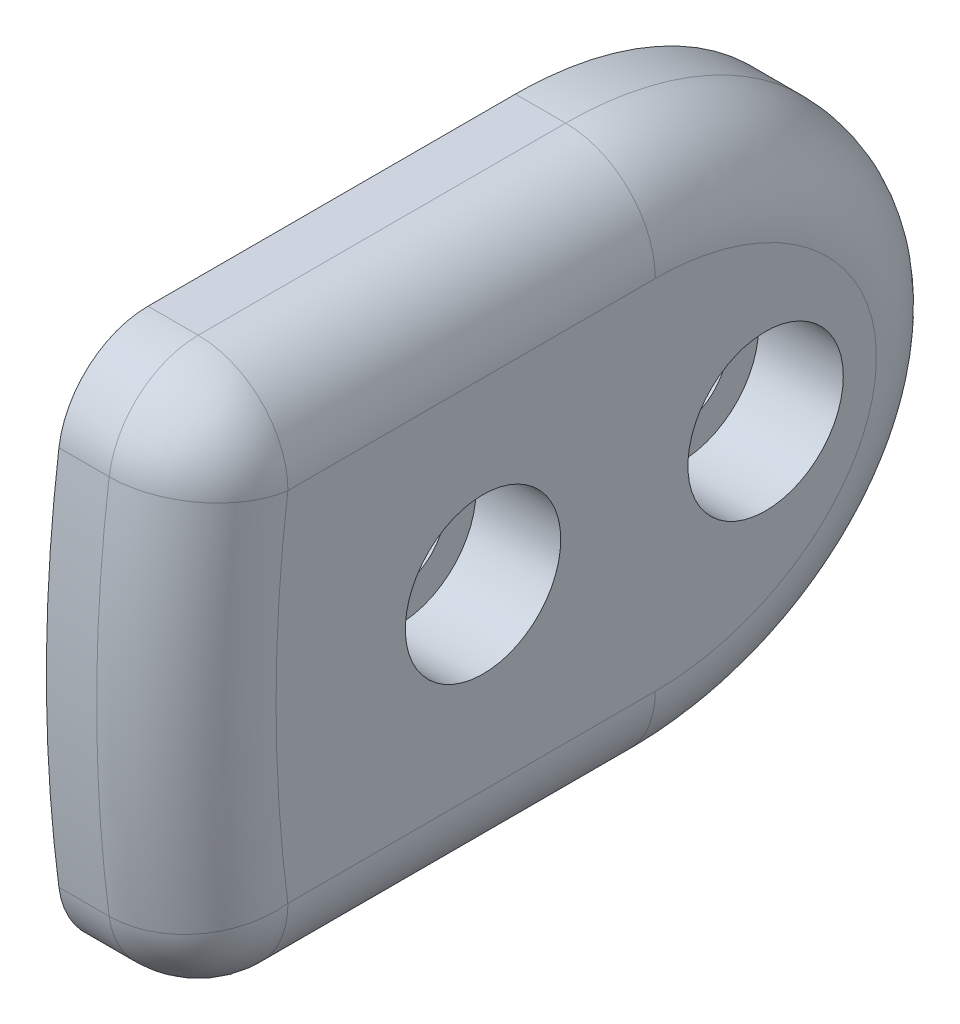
ISO-10303-21;
HEADER;
FILE_DESCRIPTION(('STEP AP214'),'2;1');
FILE_NAME('part.step','',(''),(''),'','','');
FILE_SCHEMA(('AUTOMOTIVE_DESIGN { 1 0 10303 214 1 1 1 1 }'));
ENDSEC;
DATA;
#1=APPLICATION_CONTEXT('core data for automotive mechanical design processes');
#2=APPLICATION_PROTOCOL_DEFINITION('international standard','automotive_design',2000,#1);
#3=PRODUCT_CONTEXT('',#1,'mechanical');
#4=PRODUCT('Part','Part','',(#3));
#5=PRODUCT_RELATED_PRODUCT_CATEGORY('part','',(#4));
#6=PRODUCT_DEFINITION_FORMATION('','',#4);
#7=PRODUCT_DEFINITION_CONTEXT('part definition',#1,'design');
#8=PRODUCT_DEFINITION('design','',#6,#7);
#9=PRODUCT_DEFINITION_SHAPE('','',#8);
#10=(LENGTH_UNIT() NAMED_UNIT(*) SI_UNIT(.MILLI.,.METRE.));
#11=(NAMED_UNIT(*) PLANE_ANGLE_UNIT() SI_UNIT($,.RADIAN.));
#12=(NAMED_UNIT(*) SI_UNIT($,.STERADIAN.) SOLID_ANGLE_UNIT());
#13=UNCERTAINTY_MEASURE_WITH_UNIT(LENGTH_MEASURE(1.E-05),#10,'distance_accuracy_value','');
#14=(GEOMETRIC_REPRESENTATION_CONTEXT(3) GLOBAL_UNCERTAINTY_ASSIGNED_CONTEXT((#13)) GLOBAL_UNIT_ASSIGNED_CONTEXT((#10,
#11,#12)) REPRESENTATION_CONTEXT('',''));
#15=CARTESIAN_POINT('',(0.,0.,0.));
#16=DIRECTION('',(0.,0.,1.));
#17=DIRECTION('',(1.,0.,0.));
#18=AXIS2_PLACEMENT_3D('',#15,#16,#17);
#19=CARTESIAN_POINT('',(9.906,12.6399999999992,95.809811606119));
#20=DIRECTION('',(-1.,0.,0.));
#21=DIRECTION('',(0.,0.,1.));
#22=AXIS2_PLACEMENT_3D('',#19,#20,#21);
#23=CYLINDRICAL_SURFACE('',#22,6.36);
#24=DIRECTION('',(-1.,0.,0.));
#25=VECTOR('',#24,1.);
#26=CARTESIAN_POINT('',(9.906,13.4718543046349,102.11517586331));
#27=LINE('',#26,#25);
#28=CARTESIAN_POINT('',(3.556,13.4718543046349,102.11517586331));
#29=VERTEX_POINT('',#28);
#30=CARTESIAN_POINT('',(0.,13.4718543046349,102.11517586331));
#31=VERTEX_POINT('',#30);
#32=EDGE_CURVE('E243',#29,#31,#27,.T.);
#33=ORIENTED_EDGE('',*,*,#32,.F.);
#34=CARTESIAN_POINT('',(3.556,12.6399999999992,95.809811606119));
#35=DIRECTION('',(1.,0.,0.));
#36=DIRECTION('',(0.,0.,-1.));
#37=AXIS2_PLACEMENT_3D('',#34,#35,#36);
#38=CIRCLE('',#37,6.36);
#39=CARTESIAN_POINT('',(3.556,18.9999999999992,95.809811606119));
#40=VERTEX_POINT('',#39);
#41=EDGE_CURVE('E201',#29,#40,#38,.F.);
#42=ORIENTED_EDGE('',*,*,#41,.T.);
#43=DIRECTION('',(-1.,0.,0.));
#44=VECTOR('',#43,1.);
#45=CARTESIAN_POINT('',(9.906,18.9999999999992,95.809811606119));
#46=LINE('',#45,#44);
#47=CARTESIAN_POINT('',(0.,18.9999999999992,95.809811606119));
#48=VERTEX_POINT('',#47);
#49=EDGE_CURVE('E147',#40,#48,#46,.T.);
#50=ORIENTED_EDGE('',*,*,#49,.T.);
#51=CARTESIAN_POINT('',(0.,12.6399999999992,95.809811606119));
#52=DIRECTION('',(1.,0.,0.));
#53=DIRECTION('',(0.,0.,-1.));
#54=AXIS2_PLACEMENT_3D('',#51,#52,#53);
#55=CIRCLE('',#54,6.36);
#56=EDGE_CURVE('E116',#48,#31,#55,.T.);
#57=ORIENTED_EDGE('',*,*,#56,.T.);
#58=EDGE_LOOP('',(#33,#42,#50,#57));
#59=FACE_BOUND('',#58,.T.);
#60=ADVANCED_FACE('F38',(#59),#23,.T.);
#61=CARTESIAN_POINT('',(9.906,0.,0.));
#62=DIRECTION('',(-1.,0.,0.));
#63=DIRECTION('',(0.,0.,1.));
#64=AXIS2_PLACEMENT_3D('',#61,#62,#63);
#65=CYLINDRICAL_SURFACE('',#64,103.);
#66=DIRECTION('',(-1.,0.,0.));
#67=VECTOR('',#66,1.);
#68=CARTESIAN_POINT('',(9.906,-13.4718543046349,102.11517586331));
#69=LINE('',#68,#67);
#70=CARTESIAN_POINT('',(3.556,-13.4718543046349,102.11517586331));
#71=VERTEX_POINT('',#70);
#72=CARTESIAN_POINT('',(0.,-13.4718543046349,102.11517586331));
#73=VERTEX_POINT('',#72);
#74=EDGE_CURVE('E122',#71,#73,#69,.T.);
#75=ORIENTED_EDGE('',*,*,#74,.F.);
#76=CARTESIAN_POINT('',(3.556,0.,0.));
#77=DIRECTION('',(1.,0.,0.));
#78=DIRECTION('',(0.,0.,-1.));
#79=AXIS2_PLACEMENT_3D('',#76,#77,#78);
#80=CIRCLE('',#79,103.);
#81=EDGE_CURVE('E47',#71,#29,#80,.F.);
#82=ORIENTED_EDGE('',*,*,#81,.T.);
#83=ORIENTED_EDGE('',*,*,#32,.T.);
#84=CARTESIAN_POINT('',(0.,0.,0.));
#85=DIRECTION('',(1.,0.,0.));
#86=DIRECTION('',(0.,0.,-1.));
#87=AXIS2_PLACEMENT_3D('',#84,#85,#86);
#88=CIRCLE('',#87,103.);
#89=EDGE_CURVE('E141',#31,#73,#88,.T.);
#90=ORIENTED_EDGE('',*,*,#89,.T.);
#91=EDGE_LOOP('',(#75,#82,#83,#90));
#92=FACE_BOUND('',#91,.T.);
#93=ADVANCED_FACE('F158',(#92),#65,.T.);
#94=CARTESIAN_POINT('',(9.906,-7.6492442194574E-13,69.805461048));
#95=DIRECTION('',(1.,0.,0.));
#96=DIRECTION('',(0.,0.,-1.));
#97=AXIS2_PLACEMENT_3D('',#94,#95,#96);
#98=ELLIPSE('',#97,22.,19.);
#99=DIRECTION('',(-1.,0.,0.));
#100=VECTOR('',#99,1.);
#101=SURFACE_OF_LINEAR_EXTRUSION('',#98,#100);
#102=DIRECTION('',(-1.,0.,0.));
#103=VECTOR('',#102,1.);
#104=CARTESIAN_POINT('',(9.906,18.9999999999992,69.805461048));
#105=LINE('',#104,#103);
#106=CARTESIAN_POINT('',(3.556,18.9999999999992,69.805461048));
#107=VERTEX_POINT('',#106);
#108=CARTESIAN_POINT('',(0.,18.9999999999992,69.805461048));
#109=VERTEX_POINT('',#108);
#110=EDGE_CURVE('E245',#107,#109,#105,.T.);
#111=ORIENTED_EDGE('',*,*,#110,.F.);
#112=CARTESIAN_POINT('',(9.906,11.321750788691,76.7502889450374));
#113=CARTESIAN_POINT('',(9.906,17.2091864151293,79.1294908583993));
#114=CARTESIAN_POINT('',(3.556,17.2091864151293,79.1294908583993));
#115=CARTESIAN_POINT('',(9.906,11.50258402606,76.3027592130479));
#116=CARTESIAN_POINT('',(9.906,17.4559450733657,78.5186164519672));
#117=CARTESIAN_POINT('',(3.556,17.4559450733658,78.5186164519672));
#118=CARTESIAN_POINT('',(9.906,11.6647955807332,75.8478121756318));
#119=CARTESIAN_POINT('',(9.906,17.676155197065,77.9007972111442));
#120=CARTESIAN_POINT('',(3.556,17.676155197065,77.9007972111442));
#121=CARTESIAN_POINT('',(9.906,11.9522029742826,74.9262733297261));
#122=CARTESIAN_POINT('',(9.906,18.0649243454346,76.6543807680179));
#123=CARTESIAN_POINT('',(3.556,18.0649243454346,76.6543807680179));
#124=CARTESIAN_POINT('',(9.906,12.0773926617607,74.4596796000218));
#125=CARTESIAN_POINT('',(9.906,18.233474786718,76.0257817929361));
#126=CARTESIAN_POINT('',(3.556,18.233474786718,76.0257817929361));
#127=CARTESIAN_POINT('',(9.906,12.2899968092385,73.5222763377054));
#128=CARTESIAN_POINT('',(9.906,18.5190440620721,74.7666142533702));
#129=CARTESIAN_POINT('',(3.556,18.5190440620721,74.7666142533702));
#130=CARTESIAN_POINT('',(9.906,12.3777298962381,73.0515386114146));
#131=CARTESIAN_POINT('',(9.906,18.636497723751,74.1361102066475));
#132=CARTESIAN_POINT('',(3.556,18.636497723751,74.1361102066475));
#133=CARTESIAN_POINT('',(9.906,12.5171202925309,72.1049306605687));
#134=CARTESIAN_POINT('',(9.906,18.8228479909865,72.8706163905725));
#135=CARTESIAN_POINT('',(3.556,18.8228479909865,72.8706163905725));
#136=CARTESIAN_POINT('',(9.906,12.5687941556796,71.6290628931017));
#137=CARTESIAN_POINT('',(9.906,18.8917668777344,72.2356288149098));
#138=CARTESIAN_POINT('',(3.556,18.8917668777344,72.2356288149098));
#139=CARTESIAN_POINT('',(9.906,12.6183307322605,70.9281013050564));
#140=CARTESIAN_POINT('',(9.906,18.9578053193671,71.3011250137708));
#141=CARTESIAN_POINT('',(3.556,18.9578053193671,71.3011250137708));
#142=CARTESIAN_POINT('',(9.906,12.6301975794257,70.7039186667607));
#143=CARTESIAN_POINT('',(9.906,18.9736184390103,71.0023767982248));
#144=CARTESIAN_POINT('',(3.556,18.9736184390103,71.0023767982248));
#145=CARTESIAN_POINT('',(9.906,12.6460375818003,70.2549886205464));
#146=CARTESIAN_POINT('',(9.906,18.9947222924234,70.4042538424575));
#147=CARTESIAN_POINT('',(3.556,18.9947222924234,70.4042538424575));
#148=CARTESIAN_POINT('',(9.906,12.6500004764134,70.0302408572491));
#149=CARTESIAN_POINT('',(9.906,18.9999993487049,70.1048787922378));
#150=CARTESIAN_POINT('',(3.556,18.9999993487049,70.1048787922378));
#151=CARTESIAN_POINT('',(9.906,12.6499987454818,69.2135596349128));
#152=CARTESIAN_POINT('',(9.906,19.0000017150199,69.0170192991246));
#153=CARTESIAN_POINT('',(3.556,19.0000017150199,69.0170192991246));
#154=CARTESIAN_POINT('',(9.906,12.6225154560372,68.6214360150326));
#155=CARTESIAN_POINT('',(9.906,18.9634168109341,68.2282815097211));
#156=CARTESIAN_POINT('',(3.556,18.9634168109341,68.2282815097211));
#157=CARTESIAN_POINT('',(9.906,12.512444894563,67.4419434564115));
#158=CARTESIAN_POINT('',(9.906,18.8165809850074,66.654831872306));
#159=CARTESIAN_POINT('',(3.556,18.8165809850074,66.654831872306));
#160=CARTESIAN_POINT('',(9.906,12.4298129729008,66.8545787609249));
#161=CARTESIAN_POINT('',(9.906,18.7062703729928,65.8701238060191));
#162=CARTESIAN_POINT('',(3.556,18.7062703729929,65.8701238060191));
#163=CARTESIAN_POINT('',(9.906,12.2089729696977,65.689280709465));
#164=CARTESIAN_POINT('',(9.906,18.4103555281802,64.3086753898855));
#165=CARTESIAN_POINT('',(3.556,18.4103555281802,64.3086753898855));
#166=CARTESIAN_POINT('',(9.906,12.0706690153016,65.1113654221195));
#167=CARTESIAN_POINT('',(9.906,18.2246214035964,63.5319511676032));
#168=CARTESIAN_POINT('',(3.556,18.2246214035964,63.5319511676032));
#169=CARTESIAN_POINT('',(9.906,11.7381710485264,63.9720383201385));
#170=CARTESIAN_POINT('',(9.906,17.7757026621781,61.9936839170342));
#171=CARTESIAN_POINT('',(3.556,17.7757026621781,61.9936839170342));
#172=CARTESIAN_POINT('',(9.906,11.5440064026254,63.4106180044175));
#173=CARTESIAN_POINT('',(9.906,17.5125587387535,61.2321331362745));
#174=CARTESIAN_POINT('',(3.556,17.5125587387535,61.2321331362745));
#175=CARTESIAN_POINT('',(9.906,11.157304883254,62.4537018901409));
#176=CARTESIAN_POINT('',(9.906,16.9847225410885,59.9259901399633));
#177=CARTESIAN_POINT('',(3.556,16.9847225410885,59.9259901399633));
#178=CARTESIAN_POINT('',(9.906,10.9774807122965,62.0530309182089));
#179=CARTESIAN_POINT('',(9.906,16.7382358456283,59.3764882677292));
#180=CARTESIAN_POINT('',(3.556,16.7382358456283,59.3764882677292));
#181=CARTESIAN_POINT('',(9.906,10.5869250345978,61.2670076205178));
#182=CARTESIAN_POINT('',(9.906,16.1995975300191,58.2924314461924));
#183=CARTESIAN_POINT('',(3.556,16.1995975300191,58.2924314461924));
#184=CARTESIAN_POINT('',(9.906,10.3761960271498,60.8816540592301));
#185=CARTESIAN_POINT('',(9.906,15.9074496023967,57.7578752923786));
#186=CARTESIAN_POINT('',(3.556,15.9074496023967,57.7578752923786));
#187=CARTESIAN_POINT('',(9.906,9.92422904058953,60.1301916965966));
#188=CARTESIAN_POINT('',(9.906,15.2763205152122,56.7085292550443));
#189=CARTESIAN_POINT('',(3.556,15.2763205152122,56.7085292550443));
#190=CARTESIAN_POINT('',(9.906,9.68304719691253,59.7640491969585));
#191=CARTESIAN_POINT('',(9.906,14.9374254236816,56.1937052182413));
#192=CARTESIAN_POINT('',(3.556,14.9374254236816,56.1937052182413));
#193=CARTESIAN_POINT('',(9.906,9.17003714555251,59.0538827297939));
#194=CARTESIAN_POINT('',(9.906,14.2105615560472,55.1874949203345));
#195=CARTESIAN_POINT('',(3.556,14.2105615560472,55.1874949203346));
#196=CARTESIAN_POINT('',(9.906,8.89821404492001,58.7098550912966));
#197=CARTESIAN_POINT('',(9.906,13.8226009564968,54.6961047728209));
#198=CARTESIAN_POINT('',(3.556,13.8226009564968,54.6961047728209));
#199=CARTESIAN_POINT('',(9.906,8.37750267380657,58.1092299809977));
#200=CARTESIAN_POINT('',(9.906,13.0724068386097,53.8307837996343));
#201=CARTESIAN_POINT('',(3.556,13.0724068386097,53.8307837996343));
#202=CARTESIAN_POINT('',(9.906,8.13367799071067,57.8482340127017));
#203=CARTESIAN_POINT('',(9.906,12.718696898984,53.4519436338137));
#204=CARTESIAN_POINT('',(3.556,12.718696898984,53.4519436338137));
#205=CARTESIAN_POINT('',(9.906,7.62644994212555,57.3460438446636));
#206=CARTESIAN_POINT('',(9.906,11.9768032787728,52.7174174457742));
#207=CARTESIAN_POINT('',(3.556,11.9768032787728,52.7174174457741));
#208=CARTESIAN_POINT('',(9.906,7.3630504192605,57.1048457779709));
#209=CARTESIAN_POINT('',(9.906,11.5886263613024,52.3617269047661));
#210=CARTESIAN_POINT('',(3.556,11.5886263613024,52.3617269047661));
#211=CARTESIAN_POINT('',(9.906,6.81729056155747,56.6447731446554));
#212=CARTESIAN_POINT('',(9.906,10.7772715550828,51.677760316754));
#213=CARTESIAN_POINT('',(3.556,10.7772715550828,51.677760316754));
#214=CARTESIAN_POINT('',(9.906,6.53492645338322,56.4259030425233));
#215=CARTESIAN_POINT('',(9.906,10.354086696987,51.3494897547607));
#216=CARTESIAN_POINT('',(3.556,10.354086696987,51.3494897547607));
#217=CARTESIAN_POINT('',(9.906,5.95232346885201,56.0133109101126));
#218=CARTESIAN_POINT('',(9.906,9.47299567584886,50.7255136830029));
#219=CARTESIAN_POINT('',(3.556,9.47299567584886,50.7255136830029));
#220=CARTESIAN_POINT('',(9.906,5.65208422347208,55.8195893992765));
#221=CARTESIAN_POINT('',(9.906,9.01508879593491,50.4298088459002));
#222=CARTESIAN_POINT('',(3.556,9.01508879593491,50.4298088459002));
#223=CARTESIAN_POINT('',(9.906,5.03243067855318,55.4585518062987));
#224=CARTESIAN_POINT('',(9.906,8.06147471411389,49.8741937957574));
#225=CARTESIAN_POINT('',(3.556,8.06147471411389,49.8741937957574));
#226=CARTESIAN_POINT('',(9.906,4.71286776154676,55.291489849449));
#227=CARTESIAN_POINT('',(9.906,7.56546362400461,49.614630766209));
#228=CARTESIAN_POINT('',(3.556,7.56546362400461,49.614630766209));
#229=CARTESIAN_POINT('',(9.906,4.05910884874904,54.9888334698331));
#230=CARTESIAN_POINT('',(9.906,6.54198114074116,49.1408159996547));
#231=CARTESIAN_POINT('',(3.556,6.54198114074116,49.1408159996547));
#232=CARTESIAN_POINT('',(9.906,3.72491257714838,54.8532396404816));
#233=CARTESIAN_POINT('',(9.906,6.01450915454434,48.9265651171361));
#234=CARTESIAN_POINT('',(3.556,6.01450915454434,48.9265651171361));
#235=CARTESIAN_POINT('',(9.906,3.04494244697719,54.6163816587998));
#236=CARTESIAN_POINT('',(9.906,4.93325381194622,48.549929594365));
#237=CARTESIAN_POINT('',(3.556,4.93325381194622,48.549929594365));
#238=CARTESIAN_POINT('',(9.906,2.69918187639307,54.5150794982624));
#239=CARTESIAN_POINT('',(9.906,4.37950036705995,48.3874875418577));
#240=CARTESIAN_POINT('',(3.556,4.37950036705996,48.3874875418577));
#241=CARTESIAN_POINT('',(9.906,1.99902826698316,54.348894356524));
#242=CARTESIAN_POINT('',(9.906,3.2517864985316,48.1198257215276));
#243=CARTESIAN_POINT('',(3.556,3.2517864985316,48.1198257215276));
#244=CARTESIAN_POINT('',(9.906,1.64463700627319,54.2840039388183));
#245=CARTESIAN_POINT('',(9.906,2.67783022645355,48.0145942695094));
#246=CARTESIAN_POINT('',(3.556,2.67783022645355,48.0145942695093));
#247=CARTESIAN_POINT('',(9.906,0.985142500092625,54.1991551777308));
#248=CARTESIAN_POINT('',(9.906,1.60621933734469,47.8767207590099));
#249=CARTESIAN_POINT('',(3.556,1.60621933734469,47.8767207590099));
#250=CARTESIAN_POINT('',(9.906,0.680714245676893,54.1738755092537));
#251=CARTESIAN_POINT('',(9.906,1.11019213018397,47.8354910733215));
#252=CARTESIAN_POINT('',(3.556,1.11019213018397,47.8354910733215));
#253=CARTESIAN_POINT('',(9.906,0.0708358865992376,54.1510871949));
#254=CARTESIAN_POINT('',(9.906,0.11565172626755,47.798331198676));
#255=CARTESIAN_POINT('',(3.556,0.11565172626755,47.798331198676));
#256=CARTESIAN_POINT('',(9.906,-0.23461409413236,54.1535752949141));
#257=CARTESIAN_POINT('',(9.906,-0.382861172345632,47.8023957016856));
#258=CARTESIAN_POINT('',(3.556,-0.382861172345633,47.8023957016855));
#259=CARTESIAN_POINT('',(9.906,-0.843944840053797,54.1862703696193));
#260=CARTESIAN_POINT('',(9.906,-1.3761542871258,47.855692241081));
#261=CARTESIAN_POINT('',(3.556,-1.3761542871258,47.855692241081));
#262=CARTESIAN_POINT('',(9.906,-1.14782595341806,54.2164709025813));
#263=CARTESIAN_POINT('',(9.906,-1.8709353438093,47.9049137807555));
#264=CARTESIAN_POINT('',(3.556,-1.8709353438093,47.9049137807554));
#265=CARTESIAN_POINT('',(9.906,-1.7516420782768,54.3040292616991));
#266=CARTESIAN_POINT('',(9.906,-2.85106858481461,48.0470398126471));
#267=CARTESIAN_POINT('',(3.556,-2.85106858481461,48.0470398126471));
#268=CARTESIAN_POINT('',(9.906,-2.05157711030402,54.3613869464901));
#269=CARTESIAN_POINT('',(9.906,-3.33642081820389,48.1399440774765));
#270=CARTESIAN_POINT('',(3.556,-3.33642081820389,48.1399440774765));
#271=CARTESIAN_POINT('',(9.906,-2.62514693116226,54.4974884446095));
#272=CARTESIAN_POINT('',(9.906,-4.2602586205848,48.3591572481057));
#273=CARTESIAN_POINT('',(3.556,-4.2602586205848,48.3591572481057));
#274=CARTESIAN_POINT('',(9.906,-2.89918949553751,54.5745254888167));
#275=CARTESIAN_POINT('',(9.906,-4.69969510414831,48.4827850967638));
#276=CARTESIAN_POINT('',(3.556,-4.69969510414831,48.4827850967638));
#277=CARTESIAN_POINT('',(9.906,-3.44021612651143,54.7502337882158));
#278=CARTESIAN_POINT('',(9.906,-5.56256481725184,48.7630166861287));
#279=CARTESIAN_POINT('',(3.556,-5.56256481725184,48.7630166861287));
#280=CARTESIAN_POINT('',(9.906,-3.70720063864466,54.8489036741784));
#281=CARTESIAN_POINT('',(9.906,-5.9859990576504,48.9196183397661));
#282=CARTESIAN_POINT('',(3.556,-5.9859990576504,48.9196183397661));
#283=CARTESIAN_POINT('',(9.906,-4.23274564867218,55.0666086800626));
#284=CARTESIAN_POINT('',(9.906,-6.81438211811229,49.2627711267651));
#285=CARTESIAN_POINT('',(3.556,-6.81438211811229,49.2627711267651));
#286=CARTESIAN_POINT('',(9.906,-4.49130525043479,55.1856459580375));
#287=CARTESIAN_POINT('',(9.906,-7.21932897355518,49.4493254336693));
#288=CARTESIAN_POINT('',(3.556,-7.21932897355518,49.4493254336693));
#289=CARTESIAN_POINT('',(9.906,-4.9988115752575,55.4426780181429));
#290=CARTESIAN_POINT('',(9.906,-8.0089289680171,49.8492264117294));
#291=CARTESIAN_POINT('',(3.556,-8.00892896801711,49.8492264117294));
#292=CARTESIAN_POINT('',(9.906,-5.24775770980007,55.5806739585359));
#293=CARTESIAN_POINT('',(9.906,-8.39358086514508,50.0625747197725));
#294=CARTESIAN_POINT('',(3.556,-8.39358086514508,50.0625747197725));
#295=CARTESIAN_POINT('',(9.906,-5.75587799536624,55.8867004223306));
#296=CARTESIAN_POINT('',(9.906,-9.17336903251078,50.5322159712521));
#297=CARTESIAN_POINT('',(3.556,-9.17336903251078,50.5322159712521));
#298=CARTESIAN_POINT('',(9.906,-6.0141152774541,56.0562884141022));
#299=CARTESIAN_POINT('',(9.906,-9.56660433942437,50.7906193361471));
#300=CARTESIAN_POINT('',(3.556,-9.56660433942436,50.7906193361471));
#301=CARTESIAN_POINT('',(9.906,-6.51725385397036,56.4142426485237));
#302=CARTESIAN_POINT('',(9.906,-10.3271862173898,51.3317355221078));
#303=CARTESIAN_POINT('',(3.556,-10.3271862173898,51.3317355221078));
#304=CARTESIAN_POINT('',(9.906,-6.76215021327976,56.602615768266));
#305=CARTESIAN_POINT('',(9.906,-10.6945232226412,51.6144572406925));
#306=CARTESIAN_POINT('',(3.556,-10.6945232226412,51.6144572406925));
#307=CARTESIAN_POINT('',(9.906,-7.47576724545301,57.1932933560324));
#308=CARTESIAN_POINT('',(9.906,-11.7573741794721,52.4941680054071));
#309=CARTESIAN_POINT('',(3.556,-11.7573741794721,52.4941680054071));
#310=CARTESIAN_POINT('',(9.906,-7.9236363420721,57.6212909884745));
#311=CARTESIAN_POINT('',(9.906,-12.4140650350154,53.1229108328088));
#312=CARTESIAN_POINT('',(3.556,-12.4140650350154,53.1229108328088));
#313=CARTESIAN_POINT('',(9.906,-8.58614145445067,58.3429397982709));
#314=CARTESIAN_POINT('',(9.906,-13.3738848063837,54.1684474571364));
#315=CARTESIAN_POINT('',(3.556,-13.3738848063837,54.1684474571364));
#316=CARTESIAN_POINT('',(9.906,-8.82060855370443,58.6189102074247));
#317=CARTESIAN_POINT('',(9.906,-13.7108833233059,54.5653039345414));
#318=CARTESIAN_POINT('',(3.556,-13.7108833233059,54.5653039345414));
#319=CARTESIAN_POINT('',(9.906,-9.2687854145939,59.187249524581));
#320=CARTESIAN_POINT('',(9.906,-14.3508443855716,55.37685174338));
#321=CARTESIAN_POINT('',(3.556,-14.3508443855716,55.37685174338));
#322=CARTESIAN_POINT('',(9.906,-9.48249379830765,59.4796195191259));
#323=CARTESIAN_POINT('',(9.906,-14.6538046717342,55.7915442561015));
#324=CARTESIAN_POINT('',(3.556,-14.6538046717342,55.7915442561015));
#325=CARTESIAN_POINT('',(9.906,-10.0923694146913,60.3784450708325));
#326=CARTESIAN_POINT('',(9.906,-15.5134171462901,57.0583708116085));
#327=CARTESIAN_POINT('',(3.556,-15.5134171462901,57.0583708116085));
#328=CARTESIAN_POINT('',(9.906,-10.4572306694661,61.0065538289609));
#329=CARTESIAN_POINT('',(9.906,-16.0207197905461,57.9331635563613));
#330=CARTESIAN_POINT('',(3.556,-16.0207197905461,57.9331635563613));
#331=CARTESIAN_POINT('',(9.906,-10.9722577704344,62.0421846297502));
#332=CARTESIAN_POINT('',(9.906,-16.7310375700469,59.3615642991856));
#333=CARTESIAN_POINT('',(3.556,-16.7310375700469,59.3615642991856));
#334=CARTESIAN_POINT('',(9.906,-11.1496901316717,62.4365962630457));
#335=CARTESIAN_POINT('',(9.906,-16.9742913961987,59.9025404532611));
#336=CARTESIAN_POINT('',(3.556,-16.9742913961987,59.9025404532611));
#337=CARTESIAN_POINT('',(9.906,-11.4747423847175,63.2375818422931));
#338=CARTESIAN_POINT('',(9.906,-17.4180505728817,60.9960427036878));
#339=CARTESIAN_POINT('',(3.556,-17.4180505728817,60.9960427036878));
#340=CARTESIAN_POINT('',(9.906,-11.6223572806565,63.6441578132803));
#341=CARTESIAN_POINT('',(9.906,-17.6185487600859,61.54857071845));
#342=CARTESIAN_POINT('',(3.556,-17.6185487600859,61.54857071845));
#343=CARTESIAN_POINT('',(9.906,-12.0204253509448,64.877884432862));
#344=CARTESIAN_POINT('',(9.906,-18.1575224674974,63.218891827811));
#345=CARTESIAN_POINT('',(3.556,-18.1575224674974,63.218891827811));
#346=CARTESIAN_POINT('',(9.906,-12.2265117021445,65.719869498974));
#347=CARTESIAN_POINT('',(9.906,-18.4340373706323,64.3505711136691));
#348=CARTESIAN_POINT('',(3.556,-18.4340373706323,64.3505711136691));
#349=CARTESIAN_POINT('',(9.906,-12.4658945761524,67.1053903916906));
#350=CARTESIAN_POINT('',(9.906,-18.7544473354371,66.2053075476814));
#351=CARTESIAN_POINT('',(3.556,-18.7544473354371,66.2053075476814));
#352=CARTESIAN_POINT('',(9.906,-12.5349633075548,67.6432033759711));
#353=CARTESIAN_POINT('',(9.906,-18.846630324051,66.9234636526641));
#354=CARTESIAN_POINT('',(3.556,-18.846630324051,66.923463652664));
#355=CARTESIAN_POINT('',(9.906,-12.6269987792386,68.7224963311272));
#356=CARTESIAN_POINT('',(9.906,-18.9693836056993,68.362897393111));
#357=CARTESIAN_POINT('',(3.556,-18.9693836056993,68.362897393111));
#358=CARTESIAN_POINT('',(9.906,-12.6499981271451,69.2639734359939));
#359=CARTESIAN_POINT('',(9.906,-18.9999974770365,69.0841724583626));
#360=CARTESIAN_POINT('',(3.556,-18.9999974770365,69.0841724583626));
#361=CARTESIAN_POINT('',(9.906,-12.650002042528,70.3960047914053));
#362=CARTESIAN_POINT('',(9.906,-19.0000027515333,70.5920948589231));
#363=CARTESIAN_POINT('',(3.556,-19.0000027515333,70.5920948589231));
#364=CARTESIAN_POINT('',(9.906,-12.6226509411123,70.9865610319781));
#365=CARTESIAN_POINT('',(9.906,-18.9635964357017,71.3787447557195));
#366=CARTESIAN_POINT('',(3.556,-18.9635964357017,71.3787447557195));
#367=CARTESIAN_POINT('',(9.906,-12.5131548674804,72.1628339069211));
#368=CARTESIAN_POINT('',(9.906,-18.8175292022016,72.9478869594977));
#369=CARTESIAN_POINT('',(3.556,-18.8175292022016,72.9478869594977));
#370=CARTESIAN_POINT('',(9.906,-12.4309844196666,72.748548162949));
#371=CARTESIAN_POINT('',(9.906,-18.7078342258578,73.730377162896));
#372=CARTESIAN_POINT('',(3.556,-18.7078342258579,73.730377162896));
#373=CARTESIAN_POINT('',(9.906,-12.2107623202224,73.9137984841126));
#374=CARTESIAN_POINT('',(9.906,-18.4127589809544,75.2917137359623));
#375=CARTESIAN_POINT('',(3.556,-18.4127589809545,75.2917137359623));
#376=CARTESIAN_POINT('',(9.906,-12.0723222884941,74.4932622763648));
#377=CARTESIAN_POINT('',(9.906,-18.2268526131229,76.070495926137));
#378=CARTESIAN_POINT('',(3.556,-18.2268526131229,76.070495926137));
#379=CARTESIAN_POINT('',(9.906,-11.8225713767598,75.3499909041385));
#380=CARTESIAN_POINT('',(9.906,-17.8896553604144,77.2271767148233));
#381=CARTESIAN_POINT('',(3.556,-17.8896553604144,77.2271767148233));
#382=CARTESIAN_POINT('',(9.906,-11.7322927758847,75.6335220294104));
#383=CARTESIAN_POINT('',(9.906,-17.7675154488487,77.6108662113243));
#384=CARTESIAN_POINT('',(3.556,-17.7675154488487,77.6108662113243));
#385=CARTESIAN_POINT('',(9.906,-11.5376233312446,76.1957307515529));
#386=CARTESIAN_POINT('',(9.906,-17.5033604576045,78.3737402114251));
#387=CARTESIAN_POINT('',(3.556,-17.5033604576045,78.3737402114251));
#388=CARTESIAN_POINT('',(9.906,-11.4332308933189,76.4744077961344));
#389=CARTESIAN_POINT('',(9.906,-17.361343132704,78.752924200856));
#390=CARTESIAN_POINT('',(3.556,-17.361343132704,78.752924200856));
#391=CARTESIAN_POINT('',(9.906,-11.3217507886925,76.7502889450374));
#392=CARTESIAN_POINT('',(9.906,-17.2091863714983,79.1294909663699));
#393=CARTESIAN_POINT('',(3.556,-17.2091863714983,79.1294909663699));
#394=(BOUNDED_SURFACE() B_SPLINE_SURFACE(3,2,((#112,#113,#114),(#115,#116,#117),(#118,#119,
#120),(#121,#122,#123),(#124,#125,#126),(#127,#128,#129),(#130,#131,#132),(#133,#134,#135),
(#136,#137,#138),(#139,#140,#141),(#142,#143,#144),(#145,#146,#147),(#148,#149,#150),(#151,#152,
#153),(#154,#155,#156),(#157,#158,#159),(#160,#161,#162),(#163,#164,#165),(#166,#167,#168),
(#169,#170,#171),(#172,#173,#174),(#175,#176,#177),(#178,#179,#180),(#181,#182,#183),(#184,#185,
#186),(#187,#188,#189),(#190,#191,#192),(#193,#194,#195),(#196,#197,#198),(#199,#200,#201),
(#202,#203,#204),(#205,#206,#207),(#208,#209,#210),(#211,#212,#213),(#214,#215,#216),(#217,#218,
#219),(#220,#221,#222),(#223,#224,#225),(#226,#227,#228),(#229,#230,#231),(#232,#233,#234),
(#235,#236,#237),(#238,#239,#240),(#241,#242,#243),(#244,#245,#246),(#247,#248,#249),(#250,#251,
#252),(#253,#254,#255),(#256,#257,#258),(#259,#260,#261),(#262,#263,#264),(#265,#266,#267),
(#268,#269,#270),(#271,#272,#273),(#274,#275,#276),(#277,#278,#279),(#280,#281,#282),(#283,#284,
#285),(#286,#287,#288),(#289,#290,#291),(#292,#293,#294),(#295,#296,#297),(#298,#299,#300),
(#301,#302,#303),(#304,#305,#306),(#307,#308,#309),(#310,#311,#312),(#313,#314,#315),(#316,#317,
#318),(#319,#320,#321),(#322,#323,#324),(#325,#326,#327),(#328,#329,#330),(#331,#332,#333),
(#334,#335,#336),(#337,#338,#339),(#340,#341,#342),(#343,#344,#345),(#346,#347,#348),(#349,#350,
#351),(#352,#353,#354),(#355,#356,#357),(#358,#359,#360),(#361,#362,#363),(#364,#365,#366),
(#367,#368,#369),(#370,#371,#372),(#373,#374,#375),(#376,#377,#378),(#379,#380,#381),(#382,#383,
#384),(#385,#386,#387),(#388,#389,#390),(#391,#392,#393)),.UNSPECIFIED.,.F.,.F.,
.F.) B_SPLINE_SURFACE_WITH_KNOTS((4,2,2,2,2,2,2,2,2,2,2,2,2,2,2,2,2,2,2,2,2,2,2,2,2,2,2,2,2,2,2,
2,2,2,2,2,2,2,2,2,2,2,2,2,2,2,4),(3,3),(0.,1.44749727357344,2.89523492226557,4.33039929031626,
5.76490437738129,6.43827370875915,7.11251661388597,8.88796668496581,10.6648559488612,
12.4448183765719,14.2238467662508,15.5401416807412,16.8563302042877,18.1701270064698,
19.4837051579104,20.5542140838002,21.62451341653,22.6950263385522,23.7655613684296,
24.8457593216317,25.9259776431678,27.004994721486,28.0837913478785,28.9990009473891,
29.9141032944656,30.8289929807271,31.7438779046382,32.5969493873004,33.4499668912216,
34.303074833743,35.1562349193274,36.0821156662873,37.0083366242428,38.8600101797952,
39.9455698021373,41.0312014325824,43.2027147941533,44.4991360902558,45.7957744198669,
48.3862847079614,50.0113220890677,51.635208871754,53.4062118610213,55.1780384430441,
56.9623078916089,57.8546534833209,58.7470999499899),(0.,1.),
.UNSPECIFIED.) GEOMETRIC_REPRESENTATION_ITEM() RATIONAL_B_SPLINE_SURFACE(((1.,0.707106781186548,
1.),(1.,0.707106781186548,1.),(1.,0.707106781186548,1.),(1.,0.707106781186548,1.),(1.,
0.707106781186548,1.),(1.,0.707106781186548,1.),(1.,0.707106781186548,1.),(1.,0.707106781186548,
1.),(1.,0.707106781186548,1.),(1.,0.707106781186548,1.),(1.,0.707106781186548,1.),(1.,
0.707106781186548,1.),(1.,0.707106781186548,1.),(1.,0.707106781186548,1.),(1.,0.707106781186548,
1.),(1.,0.707106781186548,1.),(1.,0.707106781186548,1.),(1.,0.707106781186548,1.),(1.,
0.707106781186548,1.),(1.,0.707106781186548,1.),(1.,0.707106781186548,1.),(1.,0.707106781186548,
1.),(1.,0.707106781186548,1.),(1.,0.707106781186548,1.),(1.,0.707106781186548,1.),(1.,
0.707106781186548,1.),(1.,0.707106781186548,1.),(1.,0.707106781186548,1.),(1.,0.707106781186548,
1.),(1.,0.707106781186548,1.),(1.,0.707106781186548,1.),(1.,0.707106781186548,1.),(1.,
0.707106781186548,1.),(1.,0.707106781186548,1.),(1.,0.707106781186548,1.),(1.,0.707106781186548,
1.),(1.,0.707106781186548,1.),(1.,0.707106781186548,1.),(1.,0.707106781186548,1.),(1.,
0.707106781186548,1.),(1.,0.707106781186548,1.),(1.,0.707106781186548,1.),(1.,0.707106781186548,
1.),(1.,0.707106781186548,1.),(1.,0.707106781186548,1.),(1.,0.707106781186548,1.),(1.,
0.707106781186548,1.),(1.,0.707106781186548,1.),(1.,0.707106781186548,1.),(1.,0.707106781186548,
1.),(1.,0.707106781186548,1.),(1.,0.707106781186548,1.),(1.,0.707106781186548,1.),(1.,
0.707106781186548,1.),(1.,0.707106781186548,1.),(1.,0.707106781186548,1.),(1.,0.707106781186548,
1.),(1.,0.707106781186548,1.),(1.,0.707106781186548,1.),(1.,0.707106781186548,1.),(1.,
0.707106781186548,1.),(1.,0.707106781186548,1.),(1.,0.707106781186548,1.),(1.,0.707106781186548,
1.),(1.,0.707106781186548,1.),(1.,0.707106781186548,1.),(1.,0.707106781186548,1.),(1.,
0.707106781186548,1.),(1.,0.707106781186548,1.),(1.,0.707106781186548,1.),(1.,0.707106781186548,
1.),(1.,0.707106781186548,1.),(1.,0.707106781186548,1.),(1.,0.707106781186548,1.),(1.,
0.707106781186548,1.),(1.,0.707106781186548,1.),(1.,0.707106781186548,1.),(1.,0.707106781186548,
1.),(1.,0.707106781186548,1.),(1.,0.707106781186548,1.),(1.,0.707106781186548,1.),(1.,
0.707106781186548,1.),(1.,0.707106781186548,1.),(1.,0.707106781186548,1.),(1.,0.707106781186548,
1.),(1.,0.707106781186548,1.),(1.,0.707106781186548,1.),(1.,0.707106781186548,1.),(1.,
0.707106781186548,1.),(1.,0.707106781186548,1.),(1.,0.707106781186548,1.),(1.,0.707106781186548,
1.),(1.,0.707106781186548,1.),(1.,0.707106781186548,1.))) REPRESENTATION_ITEM('') SURFACE());
#395=CARTESIAN_POINT('',(3.556,17.2091864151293,79.1294908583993));
#396=CARTESIAN_POINT('',(3.556,17.4559450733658,78.5186164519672));
#397=CARTESIAN_POINT('',(3.556,17.676155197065,77.9007972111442));
#398=CARTESIAN_POINT('',(3.556,18.0649243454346,76.6543807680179));
#399=CARTESIAN_POINT('',(3.556,18.233474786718,76.0257817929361));
#400=CARTESIAN_POINT('',(3.556,18.5190440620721,74.7666142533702));
#401=CARTESIAN_POINT('',(3.556,18.636497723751,74.1361102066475));
#402=CARTESIAN_POINT('',(3.556,18.8228479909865,72.8706163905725));
#403=CARTESIAN_POINT('',(3.556,18.8917668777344,72.2356288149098));
#404=CARTESIAN_POINT('',(3.556,18.9578053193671,71.3011250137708));
#405=CARTESIAN_POINT('',(3.556,18.9736184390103,71.0023767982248));
#406=CARTESIAN_POINT('',(3.556,18.9947222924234,70.4042538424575));
#407=CARTESIAN_POINT('',(3.556,18.9999993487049,70.1048787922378));
#408=CARTESIAN_POINT('',(3.556,19.0000017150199,69.0170192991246));
#409=CARTESIAN_POINT('',(3.556,18.9634168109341,68.2282815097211));
#410=CARTESIAN_POINT('',(3.556,18.8165809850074,66.654831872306));
#411=CARTESIAN_POINT('',(3.556,18.7062703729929,65.8701238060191));
#412=CARTESIAN_POINT('',(3.556,18.4103555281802,64.3086753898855));
#413=CARTESIAN_POINT('',(3.556,18.2246214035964,63.5319511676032));
#414=CARTESIAN_POINT('',(3.556,17.7757026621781,61.9936839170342));
#415=CARTESIAN_POINT('',(3.556,17.5125587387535,61.2321331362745));
#416=CARTESIAN_POINT('',(3.556,16.9847225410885,59.9259901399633));
#417=CARTESIAN_POINT('',(3.556,16.7382358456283,59.3764882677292));
#418=CARTESIAN_POINT('',(3.556,16.1995975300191,58.2924314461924));
#419=CARTESIAN_POINT('',(3.556,15.9074496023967,57.7578752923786));
#420=CARTESIAN_POINT('',(3.556,15.2763205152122,56.7085292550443));
#421=CARTESIAN_POINT('',(3.556,14.9374254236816,56.1937052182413));
#422=CARTESIAN_POINT('',(3.556,14.2105615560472,55.1874949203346));
#423=CARTESIAN_POINT('',(3.556,13.8226009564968,54.6961047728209));
#424=CARTESIAN_POINT('',(3.556,13.0724068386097,53.8307837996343));
#425=CARTESIAN_POINT('',(3.556,12.718696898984,53.4519436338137));
#426=CARTESIAN_POINT('',(3.556,11.9768032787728,52.7174174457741));
#427=CARTESIAN_POINT('',(3.556,11.5886263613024,52.3617269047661));
#428=CARTESIAN_POINT('',(3.556,10.7772715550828,51.677760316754));
#429=CARTESIAN_POINT('',(3.556,10.354086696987,51.3494897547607));
#430=CARTESIAN_POINT('',(3.556,9.47299567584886,50.7255136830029));
#431=CARTESIAN_POINT('',(3.556,9.01508879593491,50.4298088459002));
#432=CARTESIAN_POINT('',(3.556,8.06147471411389,49.8741937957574));
#433=CARTESIAN_POINT('',(3.556,7.56546362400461,49.614630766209));
#434=CARTESIAN_POINT('',(3.556,6.54198114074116,49.1408159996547));
#435=CARTESIAN_POINT('',(3.556,6.01450915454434,48.9265651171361));
#436=CARTESIAN_POINT('',(3.556,4.93325381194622,48.549929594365));
#437=CARTESIAN_POINT('',(3.556,4.37950036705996,48.3874875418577));
#438=CARTESIAN_POINT('',(3.556,3.2517864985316,48.1198257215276));
#439=CARTESIAN_POINT('',(3.556,2.67783022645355,48.0145942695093));
#440=CARTESIAN_POINT('',(3.556,1.60621933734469,47.8767207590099));
#441=CARTESIAN_POINT('',(3.556,1.11019213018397,47.8354910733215));
#442=CARTESIAN_POINT('',(3.556,0.115651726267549,47.798331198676));
#443=CARTESIAN_POINT('',(3.556,-0.382861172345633,47.8023957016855));
#444=CARTESIAN_POINT('',(3.556,-1.3761542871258,47.855692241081));
#445=CARTESIAN_POINT('',(3.556,-1.8709353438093,47.9049137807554));
#446=CARTESIAN_POINT('',(3.556,-2.85106858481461,48.0470398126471));
#447=CARTESIAN_POINT('',(3.556,-3.33642081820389,48.1399440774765));
#448=CARTESIAN_POINT('',(3.556,-4.2602586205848,48.3591572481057));
#449=CARTESIAN_POINT('',(3.556,-4.69969510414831,48.4827850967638));
#450=CARTESIAN_POINT('',(3.556,-5.56256481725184,48.7630166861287));
#451=CARTESIAN_POINT('',(3.556,-5.9859990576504,48.9196183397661));
#452=CARTESIAN_POINT('',(3.556,-6.81438211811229,49.2627711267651));
#453=CARTESIAN_POINT('',(3.556,-7.21932897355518,49.4493254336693));
#454=CARTESIAN_POINT('',(3.556,-8.00892896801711,49.8492264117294));
#455=CARTESIAN_POINT('',(3.556,-8.39358086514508,50.0625747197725));
#456=CARTESIAN_POINT('',(3.556,-9.17336903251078,50.5322159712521));
#457=CARTESIAN_POINT('',(3.556,-9.56660433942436,50.7906193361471));
#458=CARTESIAN_POINT('',(3.556,-10.3271862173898,51.3317355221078));
#459=CARTESIAN_POINT('',(3.556,-10.6945232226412,51.6144572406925));
#460=CARTESIAN_POINT('',(3.556,-11.7573741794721,52.4941680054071));
#461=CARTESIAN_POINT('',(3.556,-12.4140650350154,53.1229108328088));
#462=CARTESIAN_POINT('',(3.556,-13.3738848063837,54.1684474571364));
#463=CARTESIAN_POINT('',(3.556,-13.7108833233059,54.5653039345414));
#464=CARTESIAN_POINT('',(3.556,-14.3508443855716,55.37685174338));
#465=CARTESIAN_POINT('',(3.556,-14.6538046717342,55.7915442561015));
#466=CARTESIAN_POINT('',(3.556,-15.5134171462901,57.0583708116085));
#467=CARTESIAN_POINT('',(3.556,-16.0207197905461,57.9331635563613));
#468=CARTESIAN_POINT('',(3.556,-16.7310375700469,59.3615642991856));
#469=CARTESIAN_POINT('',(3.556,-16.9742913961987,59.9025404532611));
#470=CARTESIAN_POINT('',(3.556,-17.4180505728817,60.9960427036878));
#471=CARTESIAN_POINT('',(3.556,-17.6185487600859,61.54857071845));
#472=CARTESIAN_POINT('',(3.556,-18.1575224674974,63.2188918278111));
#473=CARTESIAN_POINT('',(3.556,-18.4340373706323,64.3505711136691));
#474=CARTESIAN_POINT('',(3.556,-18.7544473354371,66.2053075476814));
#475=CARTESIAN_POINT('',(3.556,-18.846630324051,66.923463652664));
#476=CARTESIAN_POINT('',(3.556,-18.9693836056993,68.362897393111));
#477=CARTESIAN_POINT('',(3.556,-18.9999974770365,69.0841724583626));
#478=CARTESIAN_POINT('',(3.556,-19.0000027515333,70.5920948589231));
#479=CARTESIAN_POINT('',(3.556,-18.9635964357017,71.3787447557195));
#480=CARTESIAN_POINT('',(3.556,-18.8175292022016,72.9478869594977));
#481=CARTESIAN_POINT('',(3.556,-18.7078342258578,73.730377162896));
#482=CARTESIAN_POINT('',(3.556,-18.4127589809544,75.2917137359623));
#483=CARTESIAN_POINT('',(3.556,-18.2268526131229,76.070495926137));
#484=CARTESIAN_POINT('',(3.556,-17.8896553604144,77.2271767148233));
#485=CARTESIAN_POINT('',(3.556,-17.7675154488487,77.6108662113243));
#486=CARTESIAN_POINT('',(3.556,-17.5033604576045,78.3737402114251));
#487=CARTESIAN_POINT('',(3.556,-17.361343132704,78.752924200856));
#488=CARTESIAN_POINT('',(3.556,-17.2091863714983,79.1294909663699));
#489=B_SPLINE_CURVE_WITH_KNOTS('',3,(#395,#396,#397,#398,#399,#400,#401,#402,#403,#404,#405,
#406,#407,#408,#409,#410,#411,#412,#413,#414,#415,#416,#417,#418,#419,#420,#421,#422,#423,#424,
#425,#426,#427,#428,#429,#430,#431,#432,#433,#434,#435,#436,#437,#438,#439,#440,#441,#442,#443,
#444,#445,#446,#447,#448,#449,#450,#451,#452,#453,#454,#455,#456,#457,#458,#459,#460,#461,#462,
#463,#464,#465,#466,#467,#468,#469,#470,#471,#472,#473,#474,#475,#476,#477,#478,#479,#480,#481,
#482,#483,#484,#485,#486,#487,#488),.UNSPECIFIED.,.F.,.F.,(4,2,2,2,2,2,2,2,2,2,2,2,2,2,2,2,2,2,
2,2,2,2,2,2,2,2,2,2,2,2,2,2,2,2,2,2,2,2,2,2,2,2,2,2,2,2,4),(0.,1.44749727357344,
2.89523492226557,4.33039929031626,5.76490437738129,6.43827370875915,7.11251661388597,
8.88796668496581,10.6648559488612,12.4448183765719,14.2238467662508,15.5401416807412,
16.8563302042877,18.1701270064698,19.4837051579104,20.5542140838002,21.62451341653,
22.6950263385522,23.7655613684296,24.8457593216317,25.9259776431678,27.004994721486,
28.0837913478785,28.9990009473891,29.9141032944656,30.8289929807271,31.7438779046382,
32.5969493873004,33.4499668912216,34.303074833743,35.1562349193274,36.0821156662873,
37.0083366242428,38.8600101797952,39.9455698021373,41.0312014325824,43.2027147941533,
44.4991360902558,45.7957744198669,48.3862847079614,50.0113220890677,51.635208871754,
53.4062118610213,55.1780384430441,56.9623078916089,57.8546534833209,58.7470999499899),.UNSPECIFIED.);
#490=CARTESIAN_POINT('',(3.556,-18.9999999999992,69.805461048));
#491=VERTEX_POINT('',#490);
#492=EDGE_CURVE('E261',#107,#491,#489,.T.);
#493=ORIENTED_EDGE('',*,*,#492,.T.);
#494=DIRECTION('',(-1.,0.,0.));
#495=VECTOR('',#494,1.);
#496=CARTESIAN_POINT('',(9.906,-18.9999999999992,69.805461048));
#497=LINE('',#496,#495);
#498=CARTESIAN_POINT('',(0.,-18.9999999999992,69.805461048));
#499=VERTEX_POINT('',#498);
#500=EDGE_CURVE('E117',#491,#499,#497,.T.);
#501=ORIENTED_EDGE('',*,*,#500,.T.);
#502=CARTESIAN_POINT('',(0.,-7.6492442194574E-13,69.805461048));
#503=DIRECTION('',(1.,0.,0.));
#504=DIRECTION('',(0.,0.,-1.));
#505=AXIS2_PLACEMENT_3D('',#502,#503,#504);
#506=ELLIPSE('',#505,22.,19.);
#507=EDGE_CURVE('E133',#499,#109,#506,.T.);
#508=ORIENTED_EDGE('',*,*,#507,.T.);
#509=EDGE_LOOP('',(#111,#493,#501,#508));
#510=FACE_BOUND('',#509,.T.);
#511=ADVANCED_FACE('F152',(#510),#101,.F.);
#512=CARTESIAN_POINT('',(9.906,18.9999999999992,95.809811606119));
#513=DIRECTION('',(0.,-1.,0.));
#514=DIRECTION('',(0.,0.,-1.));
#515=AXIS2_PLACEMENT_3D('',#512,#513,#514);
#516=PLANE('',#515);
#517=ORIENTED_EDGE('',*,*,#49,.F.);
#518=DIRECTION('',(0.,0.,1.));
#519=VECTOR('',#518,1.);
#520=CARTESIAN_POINT('',(3.556,18.9999999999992,69.805461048));
#521=LINE('',#520,#519);
#522=EDGE_CURVE('E195',#40,#107,#521,.F.);
#523=ORIENTED_EDGE('',*,*,#522,.T.);
#524=ORIENTED_EDGE('',*,*,#110,.T.);
#525=DIRECTION('',(0.,0.,1.));
#526=VECTOR('',#525,1.);
#527=CARTESIAN_POINT('',(0.,18.9999999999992,95.809811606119));
#528=LINE('',#527,#526);
#529=EDGE_CURVE('E144',#109,#48,#528,.T.);
#530=ORIENTED_EDGE('',*,*,#529,.T.);
#531=EDGE_LOOP('',(#517,#523,#524,#530));
#532=FACE_BOUND('',#531,.T.);
#533=ADVANCED_FACE('F157',(#532),#516,.F.);
#534=CARTESIAN_POINT('',(9.906,-7.6492442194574E-13,69.805461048));
#535=DIRECTION('',(1.,0.,0.));
#536=DIRECTION('',(0.,0.,-1.));
#537=AXIS2_PLACEMENT_3D('',#534,#535,#536);
#538=PLANE('',#537);
#539=CARTESIAN_POINT('',(9.906,-1.10751251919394E-13,82.0000000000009));
#540=DIRECTION('',(1.,0.,0.));
#541=DIRECTION('',(0.,0.,-1.));
#542=AXIS2_PLACEMENT_3D('',#539,#540,#541);
#543=CIRCLE('',#542,5.5);
#544=CARTESIAN_POINT('',(9.906,-1.10751251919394E-13,76.5000000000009));
#545=VERTEX_POINT('',#544);
#546=EDGE_CURVE('E411',#545,#545,#543,.T.);
#547=ORIENTED_EDGE('',*,*,#546,.F.);
#548=EDGE_LOOP('',(#547));
#549=FACE_BOUND('',#548,.T.);
#550=CARTESIAN_POINT('',(9.906,-1.09490866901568E-13,62.0000001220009));
#551=DIRECTION('',(1.,0.,0.));
#552=DIRECTION('',(0.,0.,-1.));
#553=AXIS2_PLACEMENT_3D('',#550,#551,#552);
#554=CIRCLE('',#553,5.5);
#555=CARTESIAN_POINT('',(9.906,-1.09490866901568E-13,56.5000001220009));
#556=VERTEX_POINT('',#555);
#557=EDGE_CURVE('E263',#556,#556,#554,.T.);
#558=ORIENTED_EDGE('',*,*,#557,.F.);
#559=EDGE_LOOP('',(#558));
#560=FACE_BOUND('',#559,.T.);
#561=CARTESIAN_POINT('',(9.906,-12.6399999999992,95.809811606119));
#562=DIRECTION('',(1.,0.,0.));
#563=DIRECTION('',(0.,0.,-1.));
#564=AXIS2_PLACEMENT_3D('',#561,#562,#563);
#565=CIRCLE('',#564,0.0100000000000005);
#566=CARTESIAN_POINT('',(9.906,-12.6413079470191,95.819725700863));
#567=VERTEX_POINT('',#566);
#568=CARTESIAN_POINT('',(9.906,-12.6499999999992,95.809811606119));
#569=VERTEX_POINT('',#568);
#570=EDGE_CURVE('E209',#567,#569,#565,.T.);
#571=ORIENTED_EDGE('',*,*,#570,.T.);
#572=DIRECTION('',(0.,0.,1.));
#573=VECTOR('',#572,1.);
#574=CARTESIAN_POINT('',(9.906,-12.6499999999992,69.805461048));
#575=LINE('',#574,#573);
#576=CARTESIAN_POINT('',(9.906,-12.6500000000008,69.805461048));
#577=VERTEX_POINT('',#576);
#578=EDGE_CURVE('E217',#569,#577,#575,.F.);
#579=ORIENTED_EDGE('',*,*,#578,.T.);
#580=CARTESIAN_POINT('',(9.906,-11.3217507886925,76.7502889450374));
#581=CARTESIAN_POINT('',(9.906,-11.4332308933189,76.4744077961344));
#582=CARTESIAN_POINT('',(9.906,-11.5376233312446,76.1957307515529));
#583=CARTESIAN_POINT('',(9.906,-11.7322927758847,75.6335220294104));
#584=CARTESIAN_POINT('',(9.906,-11.8225713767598,75.3499909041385));
#585=CARTESIAN_POINT('',(9.906,-12.0723222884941,74.4932622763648));
#586=CARTESIAN_POINT('',(9.906,-12.2107623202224,73.9137984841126));
#587=CARTESIAN_POINT('',(9.906,-12.4309844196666,72.748548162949));
#588=CARTESIAN_POINT('',(9.906,-12.5131548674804,72.1628339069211));
#589=CARTESIAN_POINT('',(9.906,-12.6226509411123,70.9865610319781));
#590=CARTESIAN_POINT('',(9.906,-12.650002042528,70.3960047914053));
#591=CARTESIAN_POINT('',(9.906,-12.6499981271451,69.2639734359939));
#592=CARTESIAN_POINT('',(9.906,-12.6269987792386,68.7224963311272));
#593=CARTESIAN_POINT('',(9.906,-12.5349633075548,67.6432033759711));
#594=CARTESIAN_POINT('',(9.906,-12.4658945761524,67.1053903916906));
#595=CARTESIAN_POINT('',(9.906,-12.2265117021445,65.719869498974));
#596=CARTESIAN_POINT('',(9.906,-12.0204253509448,64.8778844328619));
#597=CARTESIAN_POINT('',(9.906,-11.6223572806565,63.6441578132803));
#598=CARTESIAN_POINT('',(9.906,-11.4747423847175,63.2375818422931));
#599=CARTESIAN_POINT('',(9.906,-11.1496901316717,62.4365962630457));
#600=CARTESIAN_POINT('',(9.906,-10.9722577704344,62.0421846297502));
#601=CARTESIAN_POINT('',(9.906,-10.4572306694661,61.0065538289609));
#602=CARTESIAN_POINT('',(9.906,-10.0923694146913,60.3784450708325));
#603=CARTESIAN_POINT('',(9.906,-9.48249379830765,59.4796195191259));
#604=CARTESIAN_POINT('',(9.906,-9.2687854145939,59.187249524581));
#605=CARTESIAN_POINT('',(9.906,-8.82060855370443,58.6189102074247));
#606=CARTESIAN_POINT('',(9.906,-8.58614145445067,58.3429397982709));
#607=CARTESIAN_POINT('',(9.906,-7.9236363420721,57.6212909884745));
#608=CARTESIAN_POINT('',(9.906,-7.47576724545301,57.1932933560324));
#609=CARTESIAN_POINT('',(9.906,-6.76215021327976,56.602615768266));
#610=CARTESIAN_POINT('',(9.906,-6.51725385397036,56.4142426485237));
#611=CARTESIAN_POINT('',(9.906,-6.0141152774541,56.0562884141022));
#612=CARTESIAN_POINT('',(9.906,-5.75587799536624,55.8867004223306));
#613=CARTESIAN_POINT('',(9.906,-5.24775770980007,55.5806739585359));
#614=CARTESIAN_POINT('',(9.906,-4.9988115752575,55.4426780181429));
#615=CARTESIAN_POINT('',(9.906,-4.49130525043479,55.1856459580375));
#616=CARTESIAN_POINT('',(9.906,-4.23274564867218,55.0666086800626));
#617=CARTESIAN_POINT('',(9.906,-3.70720063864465,54.8489036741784));
#618=CARTESIAN_POINT('',(9.906,-3.44021612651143,54.7502337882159));
#619=CARTESIAN_POINT('',(9.906,-2.89918949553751,54.5745254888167));
#620=CARTESIAN_POINT('',(9.906,-2.62514693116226,54.4974884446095));
#621=CARTESIAN_POINT('',(9.906,-2.05157711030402,54.3613869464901));
#622=CARTESIAN_POINT('',(9.906,-1.7516420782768,54.3040292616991));
#623=CARTESIAN_POINT('',(9.906,-1.14782595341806,54.2164709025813));
#624=CARTESIAN_POINT('',(9.906,-0.843944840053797,54.1862703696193));
#625=CARTESIAN_POINT('',(9.906,-0.23461409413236,54.1535752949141));
#626=CARTESIAN_POINT('',(9.906,0.0708358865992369,54.1510871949));
#627=CARTESIAN_POINT('',(9.906,0.680714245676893,54.1738755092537));
#628=CARTESIAN_POINT('',(9.906,0.985142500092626,54.1991551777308));
#629=CARTESIAN_POINT('',(9.906,1.64463700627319,54.2840039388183));
#630=CARTESIAN_POINT('',(9.906,1.99902826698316,54.348894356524));
#631=CARTESIAN_POINT('',(9.906,2.69918187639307,54.5150794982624));
#632=CARTESIAN_POINT('',(9.906,3.04494244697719,54.6163816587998));
#633=CARTESIAN_POINT('',(9.906,3.72491257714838,54.8532396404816));
#634=CARTESIAN_POINT('',(9.906,4.05910884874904,54.9888334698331));
#635=CARTESIAN_POINT('',(9.906,4.71286776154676,55.291489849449));
#636=CARTESIAN_POINT('',(9.906,5.03243067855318,55.4585518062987));
#637=CARTESIAN_POINT('',(9.906,5.65208422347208,55.8195893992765));
#638=CARTESIAN_POINT('',(9.906,5.95232346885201,56.0133109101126));
#639=CARTESIAN_POINT('',(9.906,6.53492645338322,56.4259030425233));
#640=CARTESIAN_POINT('',(9.906,6.81729056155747,56.6447731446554));
#641=CARTESIAN_POINT('',(9.906,7.3630504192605,57.1048457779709));
#642=CARTESIAN_POINT('',(9.906,7.62644994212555,57.3460438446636));
#643=CARTESIAN_POINT('',(9.906,8.13367799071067,57.8482340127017));
#644=CARTESIAN_POINT('',(9.906,8.37750267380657,58.1092299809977));
#645=CARTESIAN_POINT('',(9.906,8.89821404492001,58.7098550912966));
#646=CARTESIAN_POINT('',(9.906,9.17003714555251,59.0538827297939));
#647=CARTESIAN_POINT('',(9.906,9.68304719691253,59.7640491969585));
#648=CARTESIAN_POINT('',(9.906,9.92422904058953,60.1301916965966));
#649=CARTESIAN_POINT('',(9.906,10.3761960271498,60.8816540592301));
#650=CARTESIAN_POINT('',(9.906,10.5869250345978,61.2670076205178));
#651=CARTESIAN_POINT('',(9.906,10.9774807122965,62.0530309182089));
#652=CARTESIAN_POINT('',(9.906,11.157304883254,62.4537018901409));
#653=CARTESIAN_POINT('',(9.906,11.5440064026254,63.4106180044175));
#654=CARTESIAN_POINT('',(9.906,11.7381710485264,63.9720383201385));
#655=CARTESIAN_POINT('',(9.906,12.0706690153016,65.1113654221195));
#656=CARTESIAN_POINT('',(9.906,12.2089729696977,65.689280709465));
#657=CARTESIAN_POINT('',(9.906,12.4298129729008,66.8545787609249));
#658=CARTESIAN_POINT('',(9.906,12.512444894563,67.4419434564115));
#659=CARTESIAN_POINT('',(9.906,12.6225154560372,68.6214360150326));
#660=CARTESIAN_POINT('',(9.906,12.6499987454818,69.2135596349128));
#661=CARTESIAN_POINT('',(9.906,12.6500004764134,70.0302408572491));
#662=CARTESIAN_POINT('',(9.906,12.6460375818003,70.2549886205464));
#663=CARTESIAN_POINT('',(9.906,12.6301975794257,70.7039186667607));
#664=CARTESIAN_POINT('',(9.906,12.6183307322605,70.9281013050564));
#665=CARTESIAN_POINT('',(9.906,12.5687941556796,71.6290628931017));
#666=CARTESIAN_POINT('',(9.906,12.5171202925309,72.1049306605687));
#667=CARTESIAN_POINT('',(9.906,12.3777298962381,73.0515386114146));
#668=CARTESIAN_POINT('',(9.906,12.2899968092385,73.5222763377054));
#669=CARTESIAN_POINT('',(9.906,12.0773926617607,74.4596796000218));
#670=CARTESIAN_POINT('',(9.906,11.9522029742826,74.9262733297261));
#671=CARTESIAN_POINT('',(9.906,11.6647955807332,75.8478121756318));
#672=CARTESIAN_POINT('',(9.906,11.50258402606,76.3027592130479));
#673=CARTESIAN_POINT('',(9.906,11.321750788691,76.7502889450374));
#674=B_SPLINE_CURVE_WITH_KNOTS('',3,(#580,#581,#582,#583,#584,#585,#586,#587,#588,#589,#590,
#591,#592,#593,#594,#595,#596,#597,#598,#599,#600,#601,#602,#603,#604,#605,#606,#607,#608,#609,
#610,#611,#612,#613,#614,#615,#616,#617,#618,#619,#620,#621,#622,#623,#624,#625,#626,#627,#628,
#629,#630,#631,#632,#633,#634,#635,#636,#637,#638,#639,#640,#641,#642,#643,#644,#645,#646,#647,
#648,#649,#650,#651,#652,#653,#654,#655,#656,#657,#658,#659,#660,#661,#662,#663,#664,#665,#666,
#667,#668,#669,#670,#671,#672,#673),.UNSPECIFIED.,.F.,.F.,(4,2,2,2,2,2,2,2,2,2,2,2,2,2,2,2,2,2,
2,2,2,2,2,2,2,2,2,2,2,2,2,2,2,2,2,2,2,2,2,2,2,2,2,2,2,2,4),(0.,0.892446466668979,
1.78479205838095,3.56906150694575,5.34088808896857,7.11189107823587,8.73577786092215,
10.3608152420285,12.951325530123,14.2479638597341,15.5443851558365,17.7158985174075,
18.8015301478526,19.8870897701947,21.7387633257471,22.6649842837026,23.5908650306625,
24.4440251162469,25.2971330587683,26.1501505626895,27.0032220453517,27.9181069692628,
28.8329966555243,29.7480990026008,30.6633086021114,31.7421052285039,32.8211223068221,
33.9013406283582,34.9815385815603,36.0520736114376,37.1225865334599,38.1928858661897,
39.2633947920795,40.5769729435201,41.8907697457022,43.2069582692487,44.5232531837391,
46.302281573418,48.0822440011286,49.8591332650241,51.6345833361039,52.3088262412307,
52.9821955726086,54.4167006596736,55.8518650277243,57.2996026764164,58.7470999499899),.UNSPECIFIED.);
#675=CARTESIAN_POINT('',(9.906,12.6499999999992,69.805461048));
#676=VERTEX_POINT('',#675);
#677=EDGE_CURVE('E207',#577,#676,#674,.T.);
#678=ORIENTED_EDGE('',*,*,#677,.T.);
#679=DIRECTION('',(0.,0.,1.));
#680=VECTOR('',#679,1.);
#681=CARTESIAN_POINT('',(9.906,12.6499999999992,95.809811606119));
#682=LINE('',#681,#680);
#683=CARTESIAN_POINT('',(9.906,12.6499999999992,95.809811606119));
#684=VERTEX_POINT('',#683);
#685=EDGE_CURVE('E193',#676,#684,#682,.T.);
#686=ORIENTED_EDGE('',*,*,#685,.T.);
#687=CARTESIAN_POINT('',(9.906,12.6399999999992,95.809811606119));
#688=DIRECTION('',(1.,0.,0.));
#689=DIRECTION('',(0.,0.,-1.));
#690=AXIS2_PLACEMENT_3D('',#687,#688,#689);
#691=CIRCLE('',#690,0.0100000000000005);
#692=CARTESIAN_POINT('',(9.906,12.6413079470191,95.819725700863));
#693=VERTEX_POINT('',#692);
#694=EDGE_CURVE('E202',#684,#693,#691,.T.);
#695=ORIENTED_EDGE('',*,*,#694,.T.);
#696=CARTESIAN_POINT('',(9.906,0.,0.));
#697=DIRECTION('',(1.,0.,0.));
#698=DIRECTION('',(0.,0.,-1.));
#699=AXIS2_PLACEMENT_3D('',#696,#697,#698);
#700=CIRCLE('',#699,96.65);
#701=EDGE_CURVE('E205',#693,#567,#700,.T.);
#702=ORIENTED_EDGE('',*,*,#701,.T.);
#703=EDGE_LOOP('',(#571,#579,#678,#686,#695,#702));
#704=FACE_BOUND('',#703,.T.);
#705=ADVANCED_FACE('F219',(#549,#560,#704),#538,.T.);
#706=CARTESIAN_POINT('',(0.,-7.6492442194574E-13,69.805461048));
#707=DIRECTION('',(1.,0.,0.));
#708=DIRECTION('',(0.,0.,-1.));
#709=AXIS2_PLACEMENT_3D('',#706,#707,#708);
#710=PLANE('',#709);
#711=CARTESIAN_POINT('',(0.,-1.10751251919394E-13,82.0000000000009));
#712=DIRECTION('',(1.,0.,0.));
#713=DIRECTION('',(0.,0.,-1.));
#714=AXIS2_PLACEMENT_3D('',#711,#712,#713);
#715=CIRCLE('',#714,3.3);
#716=CARTESIAN_POINT('',(0.,-1.10751251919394E-13,78.7000000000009));
#717=VERTEX_POINT('',#716);
#718=EDGE_CURVE('E404',#717,#717,#715,.T.);
#719=ORIENTED_EDGE('',*,*,#718,.T.);
#720=EDGE_LOOP('',(#719));
#721=FACE_BOUND('',#720,.T.);
#722=CARTESIAN_POINT('',(0.,-1.09490866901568E-13,62.0000001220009));
#723=DIRECTION('',(1.,0.,0.));
#724=DIRECTION('',(0.,0.,-1.));
#725=AXIS2_PLACEMENT_3D('',#722,#723,#724);
#726=CIRCLE('',#725,3.3);
#727=CARTESIAN_POINT('',(0.,-1.09490866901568E-13,58.7000001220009));
#728=VERTEX_POINT('',#727);
#729=EDGE_CURVE('E417',#728,#728,#726,.T.);
#730=ORIENTED_EDGE('',*,*,#729,.T.);
#731=EDGE_LOOP('',(#730));
#732=FACE_BOUND('',#731,.T.);
#733=ORIENTED_EDGE('',*,*,#56,.F.);
#734=ORIENTED_EDGE('',*,*,#529,.F.);
#735=ORIENTED_EDGE('',*,*,#507,.F.);
#736=DIRECTION('',(0.,0.,1.));
#737=VECTOR('',#736,1.);
#738=CARTESIAN_POINT('',(0.,-18.9999999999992,95.809811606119));
#739=LINE('',#738,#737);
#740=CARTESIAN_POINT('',(0.,-18.9999999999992,95.809811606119));
#741=VERTEX_POINT('',#740);
#742=EDGE_CURVE('E113',#499,#741,#739,.T.);
#743=ORIENTED_EDGE('',*,*,#742,.T.);
#744=CARTESIAN_POINT('',(0.,-12.6399999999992,95.809811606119));
#745=DIRECTION('',(-1.,0.,0.));
#746=DIRECTION('',(0.,0.,-1.));
#747=AXIS2_PLACEMENT_3D('',#744,#745,#746);
#748=CIRCLE('',#747,6.36);
#749=EDGE_CURVE('E120',#741,#73,#748,.T.);
#750=ORIENTED_EDGE('',*,*,#749,.T.);
#751=ORIENTED_EDGE('',*,*,#89,.F.);
#752=EDGE_LOOP('',(#733,#734,#735,#743,#750,#751));
#753=FACE_BOUND('',#752,.T.);
#754=ADVANCED_FACE('F130',(#721,#732,#753),#710,.F.);
#755=CARTESIAN_POINT('',(9.906,-12.6399999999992,95.809811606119));
#756=DIRECTION('',(-1.,0.,0.));
#757=DIRECTION('',(0.,0.,1.));
#758=AXIS2_PLACEMENT_3D('',#755,#756,#757);
#759=CYLINDRICAL_SURFACE('',#758,6.36);
#760=DIRECTION('',(-1.,0.,0.));
#761=VECTOR('',#760,1.);
#762=CARTESIAN_POINT('',(9.906,-18.9999999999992,95.809811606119));
#763=LINE('',#762,#761);
#764=CARTESIAN_POINT('',(3.556,-18.9999999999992,95.809811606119));
#765=VERTEX_POINT('',#764);
#766=EDGE_CURVE('E108',#765,#741,#763,.T.);
#767=ORIENTED_EDGE('',*,*,#766,.F.);
#768=CARTESIAN_POINT('',(3.556,-12.6399999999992,95.809811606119));
#769=DIRECTION('',(1.,0.,0.));
#770=DIRECTION('',(0.,0.,-1.));
#771=AXIS2_PLACEMENT_3D('',#768,#769,#770);
#772=CIRCLE('',#771,6.36);
#773=EDGE_CURVE('E11',#765,#71,#772,.F.);
#774=ORIENTED_EDGE('',*,*,#773,.T.);
#775=ORIENTED_EDGE('',*,*,#74,.T.);
#776=ORIENTED_EDGE('',*,*,#749,.F.);
#777=EDGE_LOOP('',(#767,#774,#775,#776));
#778=FACE_BOUND('',#777,.T.);
#779=ADVANCED_FACE('F121',(#778),#759,.T.);
#780=CARTESIAN_POINT('',(9.906,-18.9999999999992,95.809811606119));
#781=DIRECTION('',(0.,-1.,0.));
#782=DIRECTION('',(0.,0.,-1.));
#783=AXIS2_PLACEMENT_3D('',#780,#781,#782);
#784=PLANE('',#783);
#785=ORIENTED_EDGE('',*,*,#500,.F.);
#786=DIRECTION('',(0.,0.,1.));
#787=VECTOR('',#786,1.);
#788=CARTESIAN_POINT('',(3.556,-18.9999999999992,95.809811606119));
#789=LINE('',#788,#787);
#790=EDGE_CURVE('E115',#491,#765,#789,.T.);
#791=ORIENTED_EDGE('',*,*,#790,.T.);
#792=ORIENTED_EDGE('',*,*,#766,.T.);
#793=ORIENTED_EDGE('',*,*,#742,.F.);
#794=EDGE_LOOP('',(#785,#791,#792,#793));
#795=FACE_BOUND('',#794,.T.);
#796=ADVANCED_FACE('F111',(#795),#784,.T.);
#797=CARTESIAN_POINT('',(3.556,12.6399999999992,95.809811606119));
#798=DIRECTION('',(1.,0.,0.));
#799=DIRECTION('',(0.,0.,-1.));
#800=AXIS2_PLACEMENT_3D('',#797,#798,#799);
#801=DEGENERATE_TOROIDAL_SURFACE('',#800,0.0100000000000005,6.35,.T.);
#802=CARTESIAN_POINT('',(3.556,12.6413079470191,95.819725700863));
#803=DIRECTION('',(0.,-0.991409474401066,0.130794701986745));
#804=DIRECTION('',(0.,-0.130794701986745,-0.991409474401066));
#805=AXIS2_PLACEMENT_3D('',#802,#803,#804);
#806=CIRCLE('',#805,6.35);
#807=EDGE_CURVE('E184',#693,#29,#806,.T.);
#808=ORIENTED_EDGE('',*,*,#807,.F.);
#809=ORIENTED_EDGE('',*,*,#694,.F.);
#810=CARTESIAN_POINT('',(3.556,12.6499999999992,95.809811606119));
#811=DIRECTION('',(0.,0.,-1.));
#812=DIRECTION('',(-1.,0.,0.));
#813=AXIS2_PLACEMENT_3D('',#810,#811,#812);
#814=CIRCLE('',#813,6.35);
#815=EDGE_CURVE('E126',#40,#684,#814,.T.);
#816=ORIENTED_EDGE('',*,*,#815,.F.);
#817=ORIENTED_EDGE('',*,*,#41,.F.);
#818=EDGE_LOOP('',(#808,#809,#816,#817));
#819=FACE_BOUND('',#818,.T.);
#820=ADVANCED_FACE('F200',(#819),#801,.T.);
#821=CARTESIAN_POINT('',(3.556,12.6499999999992,69.805461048));
#822=DIRECTION('',(0.,0.,-1.));
#823=DIRECTION('',(0.,1.,0.));
#824=AXIS2_PLACEMENT_3D('',#821,#822,#823);
#825=CYLINDRICAL_SURFACE('',#824,6.35);
#826=ORIENTED_EDGE('',*,*,#815,.T.);
#827=ORIENTED_EDGE('',*,*,#685,.F.);
#828=CARTESIAN_POINT('',(3.556,12.6499999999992,69.805461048));
#829=DIRECTION('',(0.,0.,-1.));
#830=DIRECTION('',(-1.,0.,0.));
#831=AXIS2_PLACEMENT_3D('',#828,#829,#830);
#832=CIRCLE('',#831,6.35);
#833=EDGE_CURVE('E182',#107,#676,#832,.T.);
#834=ORIENTED_EDGE('',*,*,#833,.F.);
#835=ORIENTED_EDGE('',*,*,#522,.F.);
#836=EDGE_LOOP('',(#826,#827,#834,#835));
#837=FACE_BOUND('',#836,.T.);
#838=ADVANCED_FACE('F191',(#837),#825,.T.);
#839=CARTESIAN_POINT('',(3.556,0.,0.));
#840=DIRECTION('',(1.,0.,0.));
#841=DIRECTION('',(0.,0.,-1.));
#842=AXIS2_PLACEMENT_3D('',#839,#840,#841);
#843=TOROIDAL_SURFACE('',#842,96.65,6.35);
#844=ORIENTED_EDGE('',*,*,#807,.T.);
#845=ORIENTED_EDGE('',*,*,#81,.F.);
#846=CARTESIAN_POINT('',(3.556,-12.6413079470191,95.819725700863));
#847=DIRECTION('',(0.,-0.991409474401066,-0.130794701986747));
#848=DIRECTION('',(0.,0.130794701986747,-0.991409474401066));
#849=AXIS2_PLACEMENT_3D('',#846,#847,#848);
#850=CIRCLE('',#849,6.35);
#851=EDGE_CURVE('E265',#567,#71,#850,.T.);
#852=ORIENTED_EDGE('',*,*,#851,.F.);
#853=ORIENTED_EDGE('',*,*,#701,.F.);
#854=EDGE_LOOP('',(#844,#845,#852,#853));
#855=FACE_BOUND('',#854,.T.);
#856=ADVANCED_FACE('F174',(#855),#843,.T.);
#857=ORIENTED_EDGE('',*,*,#833,.T.);
#858=ORIENTED_EDGE('',*,*,#677,.F.);
#859=CARTESIAN_POINT('',(3.556,-12.6500000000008,69.805461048));
#860=DIRECTION('',(0.,0.,1.));
#861=DIRECTION('',(1.,0.,0.));
#862=AXIS2_PLACEMENT_3D('',#859,#860,#861);
#863=CIRCLE('',#862,6.35);
#864=EDGE_CURVE('E259',#491,#577,#863,.T.);
#865=ORIENTED_EDGE('',*,*,#864,.F.);
#866=ORIENTED_EDGE('',*,*,#492,.F.);
#867=EDGE_LOOP('',(#857,#858,#865,#866));
#868=FACE_BOUND('',#867,.T.);
#869=ADVANCED_FACE('F164',(#868),#394,.T.);
#870=CARTESIAN_POINT('',(3.556,-12.6399999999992,95.809811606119));
#871=DIRECTION('',(1.,0.,0.));
#872=DIRECTION('',(0.,0.,-1.));
#873=AXIS2_PLACEMENT_3D('',#870,#871,#872);
#874=DEGENERATE_TOROIDAL_SURFACE('',#873,0.0100000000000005,6.35,.T.);
#875=ORIENTED_EDGE('',*,*,#851,.T.);
#876=ORIENTED_EDGE('',*,*,#773,.F.);
#877=CARTESIAN_POINT('',(3.556,-12.6499999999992,95.809811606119));
#878=DIRECTION('',(0.,0.,-1.));
#879=DIRECTION('',(-1.,0.,0.));
#880=AXIS2_PLACEMENT_3D('',#877,#878,#879);
#881=CIRCLE('',#880,6.35);
#882=EDGE_CURVE('E257',#569,#765,#881,.T.);
#883=ORIENTED_EDGE('',*,*,#882,.F.);
#884=ORIENTED_EDGE('',*,*,#570,.F.);
#885=EDGE_LOOP('',(#875,#876,#883,#884));
#886=FACE_BOUND('',#885,.T.);
#887=ADVANCED_FACE('F262',(#886),#874,.T.);
#888=CARTESIAN_POINT('',(3.556,-12.6499999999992,95.809811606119));
#889=DIRECTION('',(0.,0.,1.));
#890=DIRECTION('',(0.,-1.,0.));
#891=AXIS2_PLACEMENT_3D('',#888,#889,#890);
#892=CYLINDRICAL_SURFACE('',#891,6.35);
#893=ORIENTED_EDGE('',*,*,#864,.T.);
#894=ORIENTED_EDGE('',*,*,#578,.F.);
#895=ORIENTED_EDGE('',*,*,#882,.T.);
#896=ORIENTED_EDGE('',*,*,#790,.F.);
#897=EDGE_LOOP('',(#893,#894,#895,#896));
#898=FACE_BOUND('',#897,.T.);
#899=ADVANCED_FACE('F256',(#898),#892,.T.);
#900=CARTESIAN_POINT('',(9.906,-1.09490866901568E-13,62.0000001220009));
#901=DIRECTION('',(1.,0.,0.));
#902=DIRECTION('',(0.,0.,-1.));
#903=AXIS2_PLACEMENT_3D('',#900,#901,#902);
#904=CYLINDRICAL_SURFACE('',#903,5.5);
#905=CARTESIAN_POINT('',(3.906,-1.09490866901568E-13,62.0000001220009));
#906=DIRECTION('',(1.,0.,0.));
#907=DIRECTION('',(0.,0.,-1.));
#908=AXIS2_PLACEMENT_3D('',#905,#906,#907);
#909=CIRCLE('',#908,5.5);
#910=CARTESIAN_POINT('',(3.906,-1.09490866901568E-13,56.5000001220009));
#911=VERTEX_POINT('',#910);
#912=EDGE_CURVE('E268',#911,#911,#909,.T.);
#913=ORIENTED_EDGE('',*,*,#912,.F.);
#914=EDGE_LOOP('',(#913));
#915=FACE_BOUND('',#914,.T.);
#916=ORIENTED_EDGE('',*,*,#557,.T.);
#917=EDGE_LOOP('',(#916));
#918=FACE_BOUND('',#917,.T.);
#919=ADVANCED_FACE('F338',(#915,#918),#904,.F.);
#920=CARTESIAN_POINT('',(3.906,3.29999999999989,62.0000001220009));
#921=DIRECTION('',(-1.,0.,0.));
#922=DIRECTION('',(0.,0.,1.));
#923=AXIS2_PLACEMENT_3D('',#920,#921,#922);
#924=PLANE('',#923);
#925=CARTESIAN_POINT('',(3.906,-1.09490866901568E-13,62.0000001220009));
#926=DIRECTION('',(1.,0.,0.));
#927=DIRECTION('',(0.,0.,-1.));
#928=AXIS2_PLACEMENT_3D('',#925,#926,#927);
#929=CIRCLE('',#928,3.3);
#930=CARTESIAN_POINT('',(3.906,-1.09490866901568E-13,58.7000001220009));
#931=VERTEX_POINT('',#930);
#932=EDGE_CURVE('E420',#931,#931,#929,.T.);
#933=ORIENTED_EDGE('',*,*,#932,.F.);
#934=EDGE_LOOP('',(#933));
#935=FACE_BOUND('',#934,.T.);
#936=ORIENTED_EDGE('',*,*,#912,.T.);
#937=EDGE_LOOP('',(#936));
#938=FACE_BOUND('',#937,.T.);
#939=ADVANCED_FACE('F347',(#935,#938),#924,.F.);
#940=CARTESIAN_POINT('',(9.906,-1.09490866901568E-13,62.0000001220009));
#941=DIRECTION('',(1.,0.,0.));
#942=DIRECTION('',(0.,0.,-1.));
#943=AXIS2_PLACEMENT_3D('',#940,#941,#942);
#944=CYLINDRICAL_SURFACE('',#943,3.3);
#945=ORIENTED_EDGE('',*,*,#729,.F.);
#946=EDGE_LOOP('',(#945));
#947=FACE_BOUND('',#946,.T.);
#948=ORIENTED_EDGE('',*,*,#932,.T.);
#949=EDGE_LOOP('',(#948));
#950=FACE_BOUND('',#949,.T.);
#951=ADVANCED_FACE('F354',(#947,#950),#944,.F.);
#952=CARTESIAN_POINT('',(9.906,-1.10751251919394E-13,82.0000000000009));
#953=DIRECTION('',(1.,0.,0.));
#954=DIRECTION('',(0.,0.,-1.));
#955=AXIS2_PLACEMENT_3D('',#952,#953,#954);
#956=CYLINDRICAL_SURFACE('',#955,5.5);
#957=CARTESIAN_POINT('',(3.906,-1.10751251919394E-13,82.0000000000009));
#958=DIRECTION('',(1.,0.,0.));
#959=DIRECTION('',(0.,0.,-1.));
#960=AXIS2_PLACEMENT_3D('',#957,#958,#959);
#961=CIRCLE('',#960,5.5);
#962=CARTESIAN_POINT('',(3.906,-1.10751251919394E-13,76.5000000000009));
#963=VERTEX_POINT('',#962);
#964=EDGE_CURVE('E408',#963,#963,#961,.T.);
#965=ORIENTED_EDGE('',*,*,#964,.F.);
#966=EDGE_LOOP('',(#965));
#967=FACE_BOUND('',#966,.T.);
#968=ORIENTED_EDGE('',*,*,#546,.T.);
#969=EDGE_LOOP('',(#968));
#970=FACE_BOUND('',#969,.T.);
#971=ADVANCED_FACE('F362',(#967,#970),#956,.F.);
#972=CARTESIAN_POINT('',(3.906,3.29999999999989,82.0000000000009));
#973=DIRECTION('',(-1.,0.,0.));
#974=DIRECTION('',(0.,0.,1.));
#975=AXIS2_PLACEMENT_3D('',#972,#973,#974);
#976=PLANE('',#975);
#977=CARTESIAN_POINT('',(3.906,-1.10751251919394E-13,82.0000000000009));
#978=DIRECTION('',(1.,0.,0.));
#979=DIRECTION('',(0.,0.,-1.));
#980=AXIS2_PLACEMENT_3D('',#977,#978,#979);
#981=CIRCLE('',#980,3.3);
#982=CARTESIAN_POINT('',(3.906,-1.10751251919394E-13,78.7000000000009));
#983=VERTEX_POINT('',#982);
#984=EDGE_CURVE('E407',#983,#983,#981,.T.);
#985=ORIENTED_EDGE('',*,*,#984,.F.);
#986=EDGE_LOOP('',(#985));
#987=FACE_BOUND('',#986,.T.);
#988=ORIENTED_EDGE('',*,*,#964,.T.);
#989=EDGE_LOOP('',(#988));
#990=FACE_BOUND('',#989,.T.);
#991=ADVANCED_FACE('F370',(#987,#990),#976,.F.);
#992=CARTESIAN_POINT('',(9.906,-1.10751251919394E-13,82.0000000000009));
#993=DIRECTION('',(1.,0.,0.));
#994=DIRECTION('',(0.,0.,-1.));
#995=AXIS2_PLACEMENT_3D('',#992,#993,#994);
#996=CYLINDRICAL_SURFACE('',#995,3.3);
#997=ORIENTED_EDGE('',*,*,#718,.F.);
#998=EDGE_LOOP('',(#997));
#999=FACE_BOUND('',#998,.T.);
#1000=ORIENTED_EDGE('',*,*,#984,.T.);
#1001=EDGE_LOOP('',(#1000));
#1002=FACE_BOUND('',#1001,.T.);
#1003=ADVANCED_FACE('F378',(#999,#1002),#996,.F.);
#1004=CLOSED_SHELL('',(#60,#93,#511,#533,#705,#754,#779,#796,#820,#838,#856,#869,#887,#899,#919,
#939,#951,#971,#991,#1003));
#1005=MANIFOLD_SOLID_BREP('B2',#1004);
#1006=ADVANCED_BREP_SHAPE_REPRESENTATION('',(#18,#1005),#14);
#1007=SHAPE_DEFINITION_REPRESENTATION(#9,#1006);
ENDSEC;
END-ISO-10303-21;
